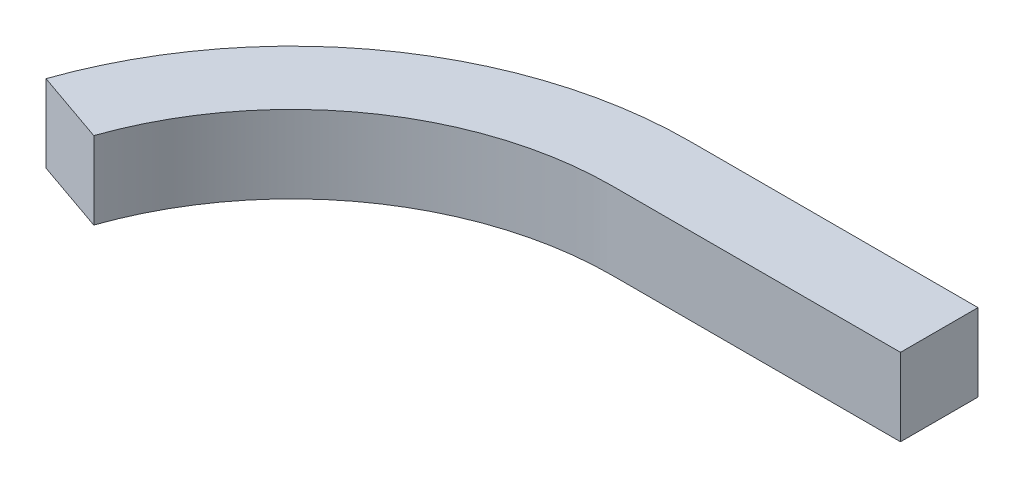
ISO-10303-21;
HEADER;
FILE_DESCRIPTION(('STEP AP214'),'2;1');
FILE_NAME('part.step','',(''),(''),'','','');
FILE_SCHEMA(('AUTOMOTIVE_DESIGN { 1 0 10303 214 1 1 1 1 }'));
ENDSEC;
DATA;
#1=APPLICATION_CONTEXT('core data for automotive mechanical design processes');
#2=APPLICATION_PROTOCOL_DEFINITION('international standard','automotive_design',2000,#1);
#3=PRODUCT_CONTEXT('',#1,'mechanical');
#4=PRODUCT('Part','Part','',(#3));
#5=PRODUCT_RELATED_PRODUCT_CATEGORY('part','',(#4));
#6=PRODUCT_DEFINITION_FORMATION('','',#4);
#7=PRODUCT_DEFINITION_CONTEXT('part definition',#1,'design');
#8=PRODUCT_DEFINITION('design','',#6,#7);
#9=PRODUCT_DEFINITION_SHAPE('','',#8);
#10=(LENGTH_UNIT() NAMED_UNIT(*) SI_UNIT(.MILLI.,.METRE.));
#11=(NAMED_UNIT(*) PLANE_ANGLE_UNIT() SI_UNIT($,.RADIAN.));
#12=(NAMED_UNIT(*) SI_UNIT($,.STERADIAN.) SOLID_ANGLE_UNIT());
#13=UNCERTAINTY_MEASURE_WITH_UNIT(LENGTH_MEASURE(1.E-05),#10,'distance_accuracy_value','');
#14=(GEOMETRIC_REPRESENTATION_CONTEXT(3) GLOBAL_UNCERTAINTY_ASSIGNED_CONTEXT((#13)) GLOBAL_UNIT_ASSIGNED_CONTEXT((#10,
#11,#12)) REPRESENTATION_CONTEXT('',''));
#15=CARTESIAN_POINT('',(0.,0.,0.));
#16=DIRECTION('',(0.,0.,1.));
#17=DIRECTION('',(1.,0.,0.));
#18=AXIS2_PLACEMENT_3D('',#15,#16,#17);
#19=CARTESIAN_POINT('',(0.,0.,0.));
#20=DIRECTION('',(1.,0.,0.));
#21=DIRECTION('',(0.,0.,-1.));
#22=AXIS2_PLACEMENT_3D('',#19,#20,#21);
#23=PLANE('',#22);
#24=DIRECTION('',(0.,1.,0.));
#25=VECTOR('',#24,1.);
#26=CARTESIAN_POINT('',(0.,-21.,-21.));
#27=LINE('',#26,#25);
#28=CARTESIAN_POINT('',(0.,-21.,-21.));
#29=VERTEX_POINT('',#28);
#30=CARTESIAN_POINT('',(0.,21.,-21.));
#31=VERTEX_POINT('',#30);
#32=EDGE_CURVE('E106',#29,#31,#27,.T.);
#33=ORIENTED_EDGE('',*,*,#32,.T.);
#34=DIRECTION('',(0.,0.,1.));
#35=VECTOR('',#34,1.);
#36=CARTESIAN_POINT('',(0.,21.,-21.));
#37=LINE('',#36,#35);
#38=CARTESIAN_POINT('',(0.,21.,21.));
#39=VERTEX_POINT('',#38);
#40=EDGE_CURVE('E111',#31,#39,#37,.T.);
#41=ORIENTED_EDGE('',*,*,#40,.T.);
#42=DIRECTION('',(0.,-1.,0.));
#43=VECTOR('',#42,1.);
#44=CARTESIAN_POINT('',(0.,-21.,21.));
#45=LINE('',#44,#43);
#46=CARTESIAN_POINT('',(0.,-21.,21.));
#47=VERTEX_POINT('',#46);
#48=EDGE_CURVE('E98',#39,#47,#45,.T.);
#49=ORIENTED_EDGE('',*,*,#48,.T.);
#50=DIRECTION('',(0.,0.,-1.));
#51=VECTOR('',#50,1.);
#52=CARTESIAN_POINT('',(0.,-21.,-21.));
#53=LINE('',#52,#51);
#54=EDGE_CURVE('E93',#47,#29,#53,.T.);
#55=ORIENTED_EDGE('',*,*,#54,.T.);
#56=EDGE_LOOP('',(#33,#41,#49,#55));
#57=FACE_BOUND('',#56,.T.);
#58=ADVANCED_FACE('F33',(#57),#23,.T.);
#59=CARTESIAN_POINT('',(-340.19826274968,0.,131.));
#60=DIRECTION('',(0.328205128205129,0.,-0.944606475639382));
#61=DIRECTION('',(-0.944606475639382,0.,-0.328205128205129));
#62=AXIS2_PLACEMENT_3D('',#59,#60,#61);
#63=PLANE('',#62);
#64=DIRECTION('',(0.,1.,0.));
#65=VECTOR('',#64,1.);
#66=CARTESIAN_POINT('',(-360.034998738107,-21.,124.107692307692));
#67=LINE('',#66,#65);
#68=CARTESIAN_POINT('',(-360.034998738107,-21.,124.107692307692));
#69=VERTEX_POINT('',#68);
#70=CARTESIAN_POINT('',(-360.034998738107,21.,124.107692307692));
#71=VERTEX_POINT('',#70);
#72=EDGE_CURVE('E65',#69,#71,#67,.T.);
#73=ORIENTED_EDGE('',*,*,#72,.F.);
#74=DIRECTION('',(-0.944606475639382,0.,-0.328205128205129));
#75=VECTOR('',#74,1.);
#76=CARTESIAN_POINT('',(-360.034998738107,-21.,124.107692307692));
#77=LINE('',#76,#75);
#78=CARTESIAN_POINT('',(-320.361526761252,-21.,137.892307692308));
#79=VERTEX_POINT('',#78);
#80=EDGE_CURVE('E11',#79,#69,#77,.T.);
#81=ORIENTED_EDGE('',*,*,#80,.F.);
#82=DIRECTION('',(0.,-1.,0.));
#83=VECTOR('',#82,1.);
#84=CARTESIAN_POINT('',(-320.361526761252,-21.,137.892307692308));
#85=LINE('',#84,#83);
#86=CARTESIAN_POINT('',(-320.361526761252,21.,137.892307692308));
#87=VERTEX_POINT('',#86);
#88=EDGE_CURVE('E52',#87,#79,#85,.T.);
#89=ORIENTED_EDGE('',*,*,#88,.F.);
#90=DIRECTION('',(0.944606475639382,0.,0.328205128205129));
#91=VECTOR('',#90,1.);
#92=CARTESIAN_POINT('',(-360.034998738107,21.,124.107692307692));
#93=LINE('',#92,#91);
#94=EDGE_CURVE('E165',#71,#87,#93,.T.);
#95=ORIENTED_EDGE('',*,*,#94,.F.);
#96=EDGE_LOOP('',(#73,#81,#89,#95));
#97=FACE_BOUND('',#96,.T.);
#98=ADVANCED_FACE('F149',(#97),#63,.F.);
#99=CARTESIAN_POINT('',(0.,-21.,-21.));
#100=CARTESIAN_POINT('',(-25.9999999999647,-21.,-21.));
#101=CARTESIAN_POINT('',(-52.0000000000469,-21.,-21.));
#102=CARTESIAN_POINT('',(-90.9999999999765,-21.,-21.));
#103=CARTESIAN_POINT('',(-104.000000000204,-21.,-21.));
#104=CARTESIAN_POINT('',(-123.499999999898,-21.,-21.));
#105=CARTESIAN_POINT('',(-129.999999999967,-21.,-21.0000000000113));
#106=CARTESIAN_POINT('',(-139.750000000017,-21.,-20.9999999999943));
#107=CARTESIAN_POINT('',(-142.999999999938,-21.,-21.));
#108=CARTESIAN_POINT('',(-147.875000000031,-21.,-21.));
#109=CARTESIAN_POINT('',(-149.500000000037,-21.,-21.));
#110=CARTESIAN_POINT('',(-151.937499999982,-21.,-21.));
#111=CARTESIAN_POINT('',(-152.750000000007,-21.,-21.));
#112=CARTESIAN_POINT('',(-153.968749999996,-21.,-21.));
#113=CARTESIAN_POINT('',(-154.374999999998,-21.,-21.));
#114=CARTESIAN_POINT('',(-155.187500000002,-21.,-21.));
#115=CARTESIAN_POINT('',(-155.571875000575,-21.,-21.0000005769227));
#116=CARTESIAN_POINT('',(-156.330831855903,-21.,-20.9999995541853));
#117=CARTESIAN_POINT('',(-156.695470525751,-21.,-20.9991602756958));
#118=CARTESIAN_POINT('',(-157.39093077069,-21.,-20.9958014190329));
#119=CARTESIAN_POINT('',(-157.738656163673,-21.,-20.9932822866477));
#120=CARTESIAN_POINT('',(-158.781806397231,-21.,-20.9832058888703));
#121=CARTESIAN_POINT('',(-159.477205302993,-21.,-20.9731296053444));
#122=CARTESIAN_POINT('',(-161.563203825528,-21.,-20.9328262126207));
#123=CARTESIAN_POINT('',(-162.953605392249,-21.,-20.8925242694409));
#124=CARTESIAN_POINT('',(-167.123256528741,-21.,-20.7313417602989));
#125=CARTESIAN_POINT('',(-169.900954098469,-21.,-20.5701795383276));
#126=CARTESIAN_POINT('',(-178.221676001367,-21.,-19.9259231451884));
#127=CARTESIAN_POINT('',(-183.752329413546,-21.,-19.28197528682));
#128=CARTESIAN_POINT('',(-200.245011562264,-21.,-16.7125547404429));
#129=CARTESIAN_POINT('',(-211.106983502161,-21.,-14.1483744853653));
#130=CARTESIAN_POINT('',(-242.907546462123,-21.,-3.99338453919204));
#131=CARTESIAN_POINT('',(-263.05016316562,-21.,6.07792270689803));
#132=CARTESIAN_POINT('',(-299.322605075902,-21.,31.8745280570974));
#133=CARTESIAN_POINT('',(-315.446937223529,-21.,47.5959195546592));
#134=CARTESIAN_POINT('',(-342.153040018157,-21.,83.2040501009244));
#135=CARTESIAN_POINT('',(-352.729806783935,-21.,103.082635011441));
#136=CARTESIAN_POINT('',(-360.034998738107,-21.,124.107692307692));
#137=CARTESIAN_POINT('',(0.,21.,-21.));
#138=CARTESIAN_POINT('',(-25.9999999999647,21.,-21.));
#139=CARTESIAN_POINT('',(-52.0000000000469,21.,-21.));
#140=CARTESIAN_POINT('',(-90.9999999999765,21.,-21.));
#141=CARTESIAN_POINT('',(-104.000000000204,21.,-21.));
#142=CARTESIAN_POINT('',(-123.499999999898,21.,-21.));
#143=CARTESIAN_POINT('',(-129.999999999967,21.,-21.0000000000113));
#144=CARTESIAN_POINT('',(-139.750000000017,21.,-20.9999999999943));
#145=CARTESIAN_POINT('',(-142.999999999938,21.,-21.));
#146=CARTESIAN_POINT('',(-147.875000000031,21.,-21.));
#147=CARTESIAN_POINT('',(-149.500000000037,21.,-21.));
#148=CARTESIAN_POINT('',(-151.937499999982,21.,-21.));
#149=CARTESIAN_POINT('',(-152.750000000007,21.,-21.));
#150=CARTESIAN_POINT('',(-153.968749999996,21.,-21.));
#151=CARTESIAN_POINT('',(-154.374999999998,21.,-21.));
#152=CARTESIAN_POINT('',(-155.187500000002,21.,-21.));
#153=CARTESIAN_POINT('',(-155.571875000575,21.,-21.0000005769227));
#154=CARTESIAN_POINT('',(-156.330831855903,21.,-20.9999995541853));
#155=CARTESIAN_POINT('',(-156.695470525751,21.,-20.9991602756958));
#156=CARTESIAN_POINT('',(-157.39093077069,21.,-20.9958014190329));
#157=CARTESIAN_POINT('',(-157.738656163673,21.,-20.9932822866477));
#158=CARTESIAN_POINT('',(-158.781806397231,21.,-20.9832058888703));
#159=CARTESIAN_POINT('',(-159.477205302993,21.,-20.9731296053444));
#160=CARTESIAN_POINT('',(-161.563203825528,21.,-20.9328262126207));
#161=CARTESIAN_POINT('',(-162.953605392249,21.,-20.8925242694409));
#162=CARTESIAN_POINT('',(-167.123256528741,21.,-20.7313417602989));
#163=CARTESIAN_POINT('',(-169.900954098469,21.,-20.5701795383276));
#164=CARTESIAN_POINT('',(-178.221676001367,21.,-19.9259231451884));
#165=CARTESIAN_POINT('',(-183.752329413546,21.,-19.28197528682));
#166=CARTESIAN_POINT('',(-200.245011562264,21.,-16.7125547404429));
#167=CARTESIAN_POINT('',(-211.106983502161,21.,-14.1483744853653));
#168=CARTESIAN_POINT('',(-242.907546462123,21.,-3.99338453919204));
#169=CARTESIAN_POINT('',(-263.05016316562,21.,6.07792270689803));
#170=CARTESIAN_POINT('',(-299.322605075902,21.,31.8745280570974));
#171=CARTESIAN_POINT('',(-315.446937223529,21.,47.5959195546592));
#172=CARTESIAN_POINT('',(-342.153040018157,21.,83.2040501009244));
#173=CARTESIAN_POINT('',(-352.729806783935,21.,103.082635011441));
#174=CARTESIAN_POINT('',(-360.034998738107,21.,124.107692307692));
#175=B_SPLINE_SURFACE_WITH_KNOTS('',1,3,((#99,#100,#101,#102,#103,#104,#105,#106,#107,#108,#109,
#110,#111,#112,#113,#114,#115,#116,#117,#118,#119,#120,#121,#122,#123,#124,#125,#126,#127,#128,
#129,#130,#131,#132,#133,#134,#135,#136),(#137,#138,#139,#140,#141,#142,#143,#144,#145,#146,
#147,#148,#149,#150,#151,#152,#153,#154,#155,#156,#157,#158,#159,#160,#161,#162,#163,#164,#165,
#166,#167,#168,#169,#170,#171,#172,#173,#174)),.UNSPECIFIED.,.F.,.F.,.F.,(2,2),(4,2,2,2,2,2,2,2,
2,2,2,2,2,2,2,2,2,2,4),(0.,1.),(0.,0.196425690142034,0.294638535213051,0.343744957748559,
0.368298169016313,0.380574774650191,0.386713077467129,0.389782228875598,0.392851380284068,
0.395223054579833,0.397594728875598,0.402338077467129,0.411824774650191,0.430798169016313,
0.468744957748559,0.544638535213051,0.696425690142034,0.848212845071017,1.),.UNSPECIFIED.);
#176=CARTESIAN_POINT('',(-156.,21.,195.));
#177=DIRECTION('',(0.,1.,0.));
#178=DIRECTION('',(0.,0.,-1.));
#179=AXIS2_PLACEMENT_3D('',#176,#177,#178);
#180=CIRCLE('',#179,216.);
#181=CARTESIAN_POINT('',(-156.,21.,-21.));
#182=VERTEX_POINT('',#181);
#183=EDGE_CURVE('E84',#182,#71,#180,.T.);
#184=DIRECTION('',(-1.,0.,0.));
#185=VECTOR('',#184,1.);
#186=CARTESIAN_POINT('',(0.,21.,-21.));
#187=LINE('',#186,#185);
#188=EDGE_CURVE('E109',#31,#182,#187,.T.);
#189=DIRECTION('',(-1.,0.,0.));
#190=VECTOR('',#189,1.);
#191=CARTESIAN_POINT('',(0.,-21.,-21.));
#192=LINE('',#191,#190);
#193=CARTESIAN_POINT('',(-156.,-21.,-21.));
#194=VERTEX_POINT('',#193);
#195=EDGE_CURVE('E108',#29,#194,#192,.T.);
#196=CARTESIAN_POINT('',(-156.,-21.,195.));
#197=DIRECTION('',(0.,1.,0.));
#198=DIRECTION('',(0.,0.,-1.));
#199=AXIS2_PLACEMENT_3D('',#196,#197,#198);
#200=CIRCLE('',#199,216.);
#201=EDGE_CURVE('E36',#194,#69,#200,.T.);
#202=ORIENTED_EDGE('',*,*,#183,.F.);
#203=ORIENTED_EDGE('',*,*,#188,.F.);
#204=ORIENTED_EDGE('',*,*,#32,.F.);
#205=ORIENTED_EDGE('',*,*,#195,.T.);
#206=ORIENTED_EDGE('',*,*,#201,.T.);
#207=ORIENTED_EDGE('',*,*,#72,.T.);
#208=EDGE_LOOP('',(#202,#203,#204,#205,#206,#207));
#209=FACE_BOUND('',#208,.T.);
#210=ADVANCED_FACE('F107',(#209),#175,.F.);
#211=CARTESIAN_POINT('',(0.,21.,-21.));
#212=DIRECTION('',(0.,-1.,0.));
#213=DIRECTION('',(0.,0.,-1.));
#214=AXIS2_PLACEMENT_3D('',#211,#212,#213);
#215=PLANE('',#214);
#216=CARTESIAN_POINT('',(-156.,21.,195.));
#217=DIRECTION('',(0.,1.,0.));
#218=DIRECTION('',(0.,0.,-1.));
#219=AXIS2_PLACEMENT_3D('',#216,#217,#218);
#220=CIRCLE('',#219,174.);
#221=CARTESIAN_POINT('',(-156.,21.,21.));
#222=VERTEX_POINT('',#221);
#223=EDGE_CURVE('E125',#222,#87,#220,.T.);
#224=ORIENTED_EDGE('',*,*,#223,.F.);
#225=DIRECTION('',(-1.,0.,0.));
#226=VECTOR('',#225,1.);
#227=CARTESIAN_POINT('',(0.,21.,21.));
#228=LINE('',#227,#226);
#229=EDGE_CURVE('E116',#39,#222,#228,.T.);
#230=ORIENTED_EDGE('',*,*,#229,.F.);
#231=ORIENTED_EDGE('',*,*,#40,.F.);
#232=ORIENTED_EDGE('',*,*,#188,.T.);
#233=ORIENTED_EDGE('',*,*,#183,.T.);
#234=ORIENTED_EDGE('',*,*,#94,.T.);
#235=EDGE_LOOP('',(#224,#230,#231,#232,#233,#234));
#236=FACE_BOUND('',#235,.T.);
#237=ADVANCED_FACE('F181',(#236),#215,.F.);
#238=CARTESIAN_POINT('',(0.,21.,21.));
#239=CARTESIAN_POINT('',(-25.9999999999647,21.,21.));
#240=CARTESIAN_POINT('',(-52.0000000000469,21.,21.));
#241=CARTESIAN_POINT('',(-90.9999999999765,21.,21.));
#242=CARTESIAN_POINT('',(-104.000000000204,21.,21.));
#243=CARTESIAN_POINT('',(-123.499999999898,21.,21.));
#244=CARTESIAN_POINT('',(-129.999999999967,21.,20.9999999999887));
#245=CARTESIAN_POINT('',(-139.750000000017,21.,21.0000000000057));
#246=CARTESIAN_POINT('',(-142.999999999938,21.,21.));
#247=CARTESIAN_POINT('',(-147.875000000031,21.,21.));
#248=CARTESIAN_POINT('',(-149.500000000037,21.,21.));
#249=CARTESIAN_POINT('',(-151.937499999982,21.,21.));
#250=CARTESIAN_POINT('',(-152.750000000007,21.,21.));
#251=CARTESIAN_POINT('',(-153.968749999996,21.,21.));
#252=CARTESIAN_POINT('',(-154.374999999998,21.,21.));
#253=CARTESIAN_POINT('',(-155.187500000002,21.,21.));
#254=CARTESIAN_POINT('',(-155.615625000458,21.,20.9999995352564));
#255=CARTESIAN_POINT('',(-156.297024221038,21.,21.0000003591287));
#256=CARTESIAN_POINT('',(-156.560240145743,21.,21.000676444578));
#257=CARTESIAN_POINT('',(-157.120472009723,21.,21.0033821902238));
#258=CARTESIAN_POINT('',(-157.400584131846,21.,21.0054114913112));
#259=CARTESIAN_POINT('',(-158.240899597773,21.,21.013528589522));
#260=CARTESIAN_POINT('',(-158.801082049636,21.,21.0216455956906));
#261=CARTESIAN_POINT('',(-160.481469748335,21.,21.0541122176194));
#262=CARTESIAN_POINT('',(-161.601515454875,21.,21.0865776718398));
#263=CARTESIAN_POINT('',(-164.96040109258,21.,21.2164191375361));
#264=CARTESIAN_POINT('',(-167.19799080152,21.,21.3462442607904));
#265=CARTESIAN_POINT('',(-173.900794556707,21.,21.8652285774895));
#266=CARTESIAN_POINT('',(-178.356043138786,21.,22.3839643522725));
#267=CARTESIAN_POINT('',(-191.641814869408,21.,24.4537753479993));
#268=CARTESIAN_POINT('',(-200.391736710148,21.,26.5193649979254));
#269=CARTESIAN_POINT('',(-226.008856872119,21.,34.6997735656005));
#270=CARTESIAN_POINT('',(-242.234853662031,21.,42.8127710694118));
#271=CARTESIAN_POINT('',(-271.454320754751,21.,63.5933698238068));
#272=CARTESIAN_POINT('',(-284.443366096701,21.,76.2578240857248));
#273=CARTESIAN_POINT('',(-305.956615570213,21.,104.942151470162));
#274=CARTESIAN_POINT('',(-314.476788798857,21.,120.955455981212));
#275=CARTESIAN_POINT('',(-320.361526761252,21.,137.892307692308));
#276=CARTESIAN_POINT('',(0.,-21.,21.));
#277=CARTESIAN_POINT('',(-25.9999999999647,-21.,21.));
#278=CARTESIAN_POINT('',(-52.0000000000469,-21.,21.));
#279=CARTESIAN_POINT('',(-90.9999999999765,-21.,21.));
#280=CARTESIAN_POINT('',(-104.000000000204,-21.,21.));
#281=CARTESIAN_POINT('',(-123.499999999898,-21.,21.));
#282=CARTESIAN_POINT('',(-129.999999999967,-21.,20.9999999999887));
#283=CARTESIAN_POINT('',(-139.750000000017,-21.,21.0000000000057));
#284=CARTESIAN_POINT('',(-142.999999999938,-21.,21.));
#285=CARTESIAN_POINT('',(-147.875000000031,-21.,21.));
#286=CARTESIAN_POINT('',(-149.500000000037,-21.,21.));
#287=CARTESIAN_POINT('',(-151.937499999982,-21.,21.));
#288=CARTESIAN_POINT('',(-152.750000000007,-21.,21.));
#289=CARTESIAN_POINT('',(-153.968749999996,-21.,21.));
#290=CARTESIAN_POINT('',(-154.374999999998,-21.,21.));
#291=CARTESIAN_POINT('',(-155.187500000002,-21.,21.));
#292=CARTESIAN_POINT('',(-155.615625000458,-21.,20.9999995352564));
#293=CARTESIAN_POINT('',(-156.297024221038,-21.,21.0000003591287));
#294=CARTESIAN_POINT('',(-156.560240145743,-21.,21.000676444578));
#295=CARTESIAN_POINT('',(-157.120472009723,-21.,21.0033821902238));
#296=CARTESIAN_POINT('',(-157.400584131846,-21.,21.0054114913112));
#297=CARTESIAN_POINT('',(-158.240899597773,-21.,21.013528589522));
#298=CARTESIAN_POINT('',(-158.801082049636,-21.,21.0216455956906));
#299=CARTESIAN_POINT('',(-160.481469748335,-21.,21.0541122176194));
#300=CARTESIAN_POINT('',(-161.601515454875,-21.,21.0865776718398));
#301=CARTESIAN_POINT('',(-164.96040109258,-21.,21.2164191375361));
#302=CARTESIAN_POINT('',(-167.19799080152,-21.,21.3462442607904));
#303=CARTESIAN_POINT('',(-173.900794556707,-21.,21.8652285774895));
#304=CARTESIAN_POINT('',(-178.356043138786,-21.,22.3839643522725));
#305=CARTESIAN_POINT('',(-191.641814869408,-21.,24.4537753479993));
#306=CARTESIAN_POINT('',(-200.391736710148,-21.,26.5193649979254));
#307=CARTESIAN_POINT('',(-226.008856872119,-21.,34.6997735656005));
#308=CARTESIAN_POINT('',(-242.234853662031,-21.,42.8127710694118));
#309=CARTESIAN_POINT('',(-271.454320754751,-21.,63.5933698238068));
#310=CARTESIAN_POINT('',(-284.443366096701,-21.,76.2578240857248));
#311=CARTESIAN_POINT('',(-305.956615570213,-21.,104.942151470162));
#312=CARTESIAN_POINT('',(-314.476788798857,-21.,120.955455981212));
#313=CARTESIAN_POINT('',(-320.361526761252,-21.,137.892307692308));
#314=B_SPLINE_SURFACE_WITH_KNOTS('',1,3,((#238,#239,#240,#241,#242,#243,#244,#245,#246,#247,
#248,#249,#250,#251,#252,#253,#254,#255,#256,#257,#258,#259,#260,#261,#262,#263,#264,#265,#266,
#267,#268,#269,#270,#271,#272,#273,#274,#275),(#276,#277,#278,#279,#280,#281,#282,#283,#284,
#285,#286,#287,#288,#289,#290,#291,#292,#293,#294,#295,#296,#297,#298,#299,#300,#301,#302,#303,
#304,#305,#306,#307,#308,#309,#310,#311,#312,#313)),.UNSPECIFIED.,.F.,.F.,.F.,(2,2),(4,2,2,2,2,
2,2,2,2,2,2,2,2,2,2,2,2,2,4),(0.,1.),(0.,0.196425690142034,0.294638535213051,0.343744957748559,
0.368298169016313,0.380574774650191,0.386713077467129,0.389782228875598,0.392851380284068,
0.395223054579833,0.397594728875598,0.402338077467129,0.411824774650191,0.430798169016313,
0.468744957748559,0.544638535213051,0.696425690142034,0.848212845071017,1.),.UNSPECIFIED.);
#315=CARTESIAN_POINT('',(-156.,-21.,195.));
#316=DIRECTION('',(0.,1.,0.));
#317=DIRECTION('',(0.,0.,-1.));
#318=AXIS2_PLACEMENT_3D('',#315,#316,#317);
#319=CIRCLE('',#318,174.);
#320=CARTESIAN_POINT('',(-156.,-21.,21.));
#321=VERTEX_POINT('',#320);
#322=EDGE_CURVE('E43',#321,#79,#319,.T.);
#323=DIRECTION('',(-1.,0.,0.));
#324=VECTOR('',#323,1.);
#325=CARTESIAN_POINT('',(0.,-21.,21.));
#326=LINE('',#325,#324);
#327=EDGE_CURVE('E172',#47,#321,#326,.T.);
#328=ORIENTED_EDGE('',*,*,#322,.F.);
#329=ORIENTED_EDGE('',*,*,#327,.F.);
#330=ORIENTED_EDGE('',*,*,#48,.F.);
#331=ORIENTED_EDGE('',*,*,#229,.T.);
#332=ORIENTED_EDGE('',*,*,#223,.T.);
#333=ORIENTED_EDGE('',*,*,#88,.T.);
#334=EDGE_LOOP('',(#328,#329,#330,#331,#332,#333));
#335=FACE_BOUND('',#334,.T.);
#336=ADVANCED_FACE('F144',(#335),#314,.F.);
#337=CARTESIAN_POINT('',(0.,-21.,-21.));
#338=DIRECTION('',(0.,1.,0.));
#339=DIRECTION('',(0.,0.,1.));
#340=AXIS2_PLACEMENT_3D('',#337,#338,#339);
#341=PLANE('',#340);
#342=ORIENTED_EDGE('',*,*,#80,.T.);
#343=ORIENTED_EDGE('',*,*,#201,.F.);
#344=ORIENTED_EDGE('',*,*,#195,.F.);
#345=ORIENTED_EDGE('',*,*,#54,.F.);
#346=ORIENTED_EDGE('',*,*,#327,.T.);
#347=ORIENTED_EDGE('',*,*,#322,.T.);
#348=EDGE_LOOP('',(#342,#343,#344,#345,#346,#347));
#349=FACE_BOUND('',#348,.T.);
#350=ADVANCED_FACE('F114',(#349),#341,.F.);
#351=CLOSED_SHELL('',(#58,#98,#210,#237,#336,#350));
#352=MANIFOLD_SOLID_BREP('B2',#351);
#353=ADVANCED_BREP_SHAPE_REPRESENTATION('',(#18,#352),#14);
#354=SHAPE_DEFINITION_REPRESENTATION(#9,#353);
ENDSEC;
END-ISO-10303-21;
